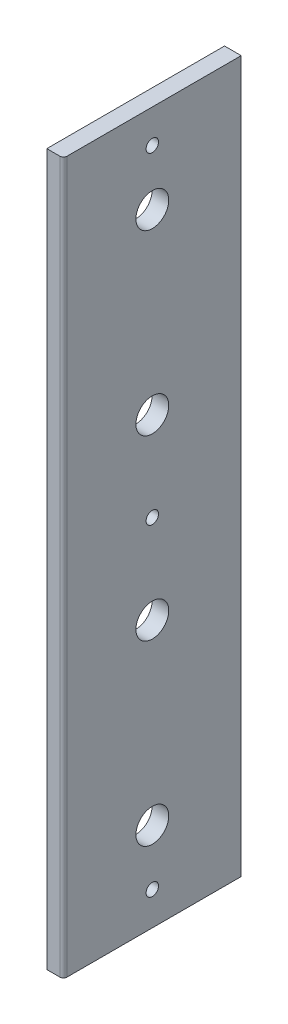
ISO-10303-21;
HEADER;
FILE_DESCRIPTION(('STEP AP214'),'2;1');
FILE_NAME('part.step','',(''),(''),'','','');
FILE_SCHEMA(('AUTOMOTIVE_DESIGN { 1 0 10303 214 1 1 1 1 }'));
ENDSEC;
DATA;
#1=APPLICATION_CONTEXT('core data for automotive mechanical design processes');
#2=APPLICATION_PROTOCOL_DEFINITION('international standard','automotive_design',2000,#1);
#3=PRODUCT_CONTEXT('',#1,'mechanical');
#4=PRODUCT('Part','Part','',(#3));
#5=PRODUCT_RELATED_PRODUCT_CATEGORY('part','',(#4));
#6=PRODUCT_DEFINITION_FORMATION('','',#4);
#7=PRODUCT_DEFINITION_CONTEXT('part definition',#1,'design');
#8=PRODUCT_DEFINITION('design','',#6,#7);
#9=PRODUCT_DEFINITION_SHAPE('','',#8);
#10=(LENGTH_UNIT() NAMED_UNIT(*) SI_UNIT(.MILLI.,.METRE.));
#11=(NAMED_UNIT(*) PLANE_ANGLE_UNIT() SI_UNIT($,.RADIAN.));
#12=(NAMED_UNIT(*) SI_UNIT($,.STERADIAN.) SOLID_ANGLE_UNIT());
#13=UNCERTAINTY_MEASURE_WITH_UNIT(LENGTH_MEASURE(1.E-05),#10,'distance_accuracy_value','');
#14=(GEOMETRIC_REPRESENTATION_CONTEXT(3) GLOBAL_UNCERTAINTY_ASSIGNED_CONTEXT((#13)) GLOBAL_UNIT_ASSIGNED_CONTEXT((#10,
#11,#12)) REPRESENTATION_CONTEXT('',''));
#15=CARTESIAN_POINT('',(0.,0.,0.));
#16=DIRECTION('',(0.,0.,1.));
#17=DIRECTION('',(1.,0.,0.));
#18=AXIS2_PLACEMENT_3D('',#15,#16,#17);
#19=CARTESIAN_POINT('',(4.7625,-25.4,0.));
#20=DIRECTION('',(0.,1.,0.));
#21=DIRECTION('',(0.,0.,1.));
#22=AXIS2_PLACEMENT_3D('',#19,#20,#21);
#23=PLANE('',#22);
#24=DIRECTION('',(0.,0.,-1.));
#25=VECTOR('',#24,1.);
#26=CARTESIAN_POINT('',(4.7625,-25.4,0.));
#27=LINE('',#26,#25);
#28=CARTESIAN_POINT('',(4.7625,-25.4,24.399999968));
#29=VERTEX_POINT('',#28);
#30=CARTESIAN_POINT('',(4.7625,-25.4,-25.4));
#31=VERTEX_POINT('',#30);
#32=EDGE_CURVE('E78',#29,#31,#27,.T.);
#33=ORIENTED_EDGE('',*,*,#32,.F.);
#34=CARTESIAN_POINT('',(3.762499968,-25.4,24.399999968));
#35=DIRECTION('',(0.,1.,0.));
#36=DIRECTION('',(0.,0.,1.));
#37=AXIS2_PLACEMENT_3D('',#34,#35,#36);
#38=CIRCLE('',#37,1.000000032);
#39=CARTESIAN_POINT('',(3.762499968,-25.4,25.4));
#40=VERTEX_POINT('',#39);
#41=EDGE_CURVE('E11',#29,#40,#38,.F.);
#42=ORIENTED_EDGE('',*,*,#41,.T.);
#43=DIRECTION('',(-1.,0.,0.));
#44=VECTOR('',#43,1.);
#45=CARTESIAN_POINT('',(4.7625,-25.4,25.4));
#46=LINE('',#45,#44);
#47=CARTESIAN_POINT('',(0.,-25.4,25.4));
#48=VERTEX_POINT('',#47);
#49=EDGE_CURVE('E108',#40,#48,#46,.T.);
#50=ORIENTED_EDGE('',*,*,#49,.T.);
#51=DIRECTION('',(0.,0.,-1.));
#52=VECTOR('',#51,1.);
#53=CARTESIAN_POINT('',(0.,-25.4,0.));
#54=LINE('',#53,#52);
#55=CARTESIAN_POINT('',(0.,-25.4,-25.4));
#56=VERTEX_POINT('',#55);
#57=EDGE_CURVE('E98',#48,#56,#54,.T.);
#58=ORIENTED_EDGE('',*,*,#57,.T.);
#59=DIRECTION('',(-1.,0.,0.));
#60=VECTOR('',#59,1.);
#61=CARTESIAN_POINT('',(4.7625,-25.4,-25.4));
#62=LINE('',#61,#60);
#63=EDGE_CURVE('E92',#31,#56,#62,.T.);
#64=ORIENTED_EDGE('',*,*,#63,.F.);
#65=EDGE_LOOP('',(#33,#42,#50,#58,#64));
#66=FACE_BOUND('',#65,.T.);
#67=ADVANCED_FACE('F35',(#66),#23,.F.);
#68=CARTESIAN_POINT('',(4.7625,0.,-25.4));
#69=DIRECTION('',(0.,0.,1.));
#70=DIRECTION('',(1.,0.,0.));
#71=AXIS2_PLACEMENT_3D('',#68,#69,#70);
#72=PLANE('',#71);
#73=DIRECTION('',(0.,1.,0.));
#74=VECTOR('',#73,1.);
#75=CARTESIAN_POINT('',(0.,0.,-25.4));
#76=LINE('',#75,#74);
#77=CARTESIAN_POINT('',(0.,177.8,-25.4));
#78=VERTEX_POINT('',#77);
#79=EDGE_CURVE('E115',#56,#78,#76,.T.);
#80=ORIENTED_EDGE('',*,*,#79,.T.);
#81=DIRECTION('',(-1.,0.,0.));
#82=VECTOR('',#81,1.);
#83=CARTESIAN_POINT('',(4.7625,177.8,-25.4));
#84=LINE('',#83,#82);
#85=CARTESIAN_POINT('',(4.7625,177.8,-25.4));
#86=VERTEX_POINT('',#85);
#87=EDGE_CURVE('E94',#86,#78,#84,.T.);
#88=ORIENTED_EDGE('',*,*,#87,.F.);
#89=DIRECTION('',(0.,1.,0.));
#90=VECTOR('',#89,1.);
#91=CARTESIAN_POINT('',(4.7625,0.,-25.4));
#92=LINE('',#91,#90);
#93=EDGE_CURVE('E81',#31,#86,#92,.T.);
#94=ORIENTED_EDGE('',*,*,#93,.F.);
#95=ORIENTED_EDGE('',*,*,#63,.T.);
#96=EDGE_LOOP('',(#80,#88,#94,#95));
#97=FACE_BOUND('',#96,.T.);
#98=ADVANCED_FACE('F91',(#97),#72,.F.);
#99=CARTESIAN_POINT('',(4.7625,177.8,0.));
#100=DIRECTION('',(0.,1.,0.));
#101=DIRECTION('',(0.,0.,1.));
#102=AXIS2_PLACEMENT_3D('',#99,#100,#101);
#103=PLANE('',#102);
#104=DIRECTION('',(-1.,0.,0.));
#105=VECTOR('',#104,1.);
#106=CARTESIAN_POINT('',(4.7625,177.8,25.4));
#107=LINE('',#106,#105);
#108=CARTESIAN_POINT('',(3.762499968,177.8,25.4));
#109=VERTEX_POINT('',#108);
#110=CARTESIAN_POINT('',(0.,177.8,25.4));
#111=VERTEX_POINT('',#110);
#112=EDGE_CURVE('E103',#109,#111,#107,.T.);
#113=ORIENTED_EDGE('',*,*,#112,.F.);
#114=CARTESIAN_POINT('',(3.762499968,177.8,24.399999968));
#115=DIRECTION('',(0.,1.,0.));
#116=DIRECTION('',(0.,0.,1.));
#117=AXIS2_PLACEMENT_3D('',#114,#115,#116);
#118=CIRCLE('',#117,1.000000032);
#119=CARTESIAN_POINT('',(4.7625,177.8,24.399999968));
#120=VERTEX_POINT('',#119);
#121=EDGE_CURVE('E57',#109,#120,#118,.T.);
#122=ORIENTED_EDGE('',*,*,#121,.T.);
#123=DIRECTION('',(0.,0.,-1.));
#124=VECTOR('',#123,1.);
#125=CARTESIAN_POINT('',(4.7625,177.8,0.));
#126=LINE('',#125,#124);
#127=EDGE_CURVE('E95',#120,#86,#126,.T.);
#128=ORIENTED_EDGE('',*,*,#127,.T.);
#129=ORIENTED_EDGE('',*,*,#87,.T.);
#130=DIRECTION('',(0.,0.,-1.));
#131=VECTOR('',#130,1.);
#132=CARTESIAN_POINT('',(0.,177.8,0.));
#133=LINE('',#132,#131);
#134=EDGE_CURVE('E112',#111,#78,#133,.T.);
#135=ORIENTED_EDGE('',*,*,#134,.F.);
#136=EDGE_LOOP('',(#113,#122,#128,#129,#135));
#137=FACE_BOUND('',#136,.T.);
#138=ADVANCED_FACE('F204',(#137),#103,.T.);
#139=CARTESIAN_POINT('',(4.7625,0.,25.4));
#140=DIRECTION('',(0.,0.,1.));
#141=DIRECTION('',(1.,0.,0.));
#142=AXIS2_PLACEMENT_3D('',#139,#140,#141);
#143=PLANE('',#142);
#144=ORIENTED_EDGE('',*,*,#49,.F.);
#145=DIRECTION('',(0.,1.,0.));
#146=VECTOR('',#145,1.);
#147=CARTESIAN_POINT('',(3.762499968,0.,25.4));
#148=LINE('',#147,#146);
#149=EDGE_CURVE('E99',#40,#109,#148,.T.);
#150=ORIENTED_EDGE('',*,*,#149,.T.);
#151=ORIENTED_EDGE('',*,*,#112,.T.);
#152=DIRECTION('',(0.,1.,0.));
#153=VECTOR('',#152,1.);
#154=CARTESIAN_POINT('',(0.,0.,25.4));
#155=LINE('',#154,#153);
#156=EDGE_CURVE('E86',#48,#111,#155,.T.);
#157=ORIENTED_EDGE('',*,*,#156,.F.);
#158=EDGE_LOOP('',(#144,#150,#151,#157));
#159=FACE_BOUND('',#158,.T.);
#160=ADVANCED_FACE('F175',(#159),#143,.T.);
#161=CARTESIAN_POINT('',(4.7625,0.,0.));
#162=DIRECTION('',(1.,0.,0.));
#163=DIRECTION('',(0.,0.,-1.));
#164=AXIS2_PLACEMENT_3D('',#161,#162,#163);
#165=PLANE('',#164);
#166=CARTESIAN_POINT('',(4.7625,-15.875,0.));
#167=DIRECTION('',(1.,0.,0.));
#168=DIRECTION('',(0.,0.,-1.));
#169=AXIS2_PLACEMENT_3D('',#166,#167,#168);
#170=CIRCLE('',#169,1.778);
#171=CARTESIAN_POINT('',(4.7625,-15.875,-1.77800000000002));
#172=VERTEX_POINT('',#171);
#173=EDGE_CURVE('E150',#172,#172,#170,.T.);
#174=ORIENTED_EDGE('',*,*,#173,.F.);
#175=EDGE_LOOP('',(#174));
#176=FACE_BOUND('',#175,.T.);
#177=CARTESIAN_POINT('',(4.7625,168.275,0.));
#178=DIRECTION('',(1.,0.,0.));
#179=DIRECTION('',(0.,0.,-1.));
#180=AXIS2_PLACEMENT_3D('',#177,#178,#179);
#181=CIRCLE('',#180,1.778);
#182=CARTESIAN_POINT('',(4.7625,168.275,-1.778));
#183=VERTEX_POINT('',#182);
#184=EDGE_CURVE('E156',#183,#183,#181,.T.);
#185=ORIENTED_EDGE('',*,*,#184,.F.);
#186=EDGE_LOOP('',(#185));
#187=FACE_BOUND('',#186,.T.);
#188=CARTESIAN_POINT('',(4.7625,76.2,0.));
#189=DIRECTION('',(1.,0.,0.));
#190=DIRECTION('',(0.,0.,-1.));
#191=AXIS2_PLACEMENT_3D('',#188,#189,#190);
#192=CIRCLE('',#191,1.778);
#193=CARTESIAN_POINT('',(4.7625,76.2,-1.778));
#194=VERTEX_POINT('',#193);
#195=EDGE_CURVE('E144',#194,#194,#192,.T.);
#196=ORIENTED_EDGE('',*,*,#195,.F.);
#197=EDGE_LOOP('',(#196));
#198=FACE_BOUND('',#197,.T.);
#199=CARTESIAN_POINT('',(4.7625,0.,0.));
#200=DIRECTION('',(1.,0.,0.));
#201=DIRECTION('',(0.,0.,-1.));
#202=AXIS2_PLACEMENT_3D('',#199,#200,#201);
#203=CIRCLE('',#202,4.699);
#204=CARTESIAN_POINT('',(4.7625,0.,4.699));
#205=VERTEX_POINT('',#204);
#206=EDGE_CURVE('E126',#205,#205,#203,.T.);
#207=ORIENTED_EDGE('',*,*,#206,.F.);
#208=EDGE_LOOP('',(#207));
#209=FACE_BOUND('',#208,.T.);
#210=CARTESIAN_POINT('',(4.7625,50.8,0.));
#211=DIRECTION('',(1.,0.,0.));
#212=DIRECTION('',(0.,0.,-1.));
#213=AXIS2_PLACEMENT_3D('',#210,#211,#212);
#214=CIRCLE('',#213,4.699);
#215=CARTESIAN_POINT('',(4.7625,50.8,4.699));
#216=VERTEX_POINT('',#215);
#217=EDGE_CURVE('E133',#216,#216,#214,.T.);
#218=ORIENTED_EDGE('',*,*,#217,.F.);
#219=EDGE_LOOP('',(#218));
#220=FACE_BOUND('',#219,.T.);
#221=CARTESIAN_POINT('',(4.7625,152.4,0.));
#222=DIRECTION('',(1.,0.,0.));
#223=DIRECTION('',(0.,0.,-1.));
#224=AXIS2_PLACEMENT_3D('',#221,#222,#223);
#225=CIRCLE('',#224,4.699);
#226=CARTESIAN_POINT('',(4.7625,152.4,4.699));
#227=VERTEX_POINT('',#226);
#228=EDGE_CURVE('E139',#227,#227,#225,.T.);
#229=ORIENTED_EDGE('',*,*,#228,.F.);
#230=EDGE_LOOP('',(#229));
#231=FACE_BOUND('',#230,.T.);
#232=CARTESIAN_POINT('',(4.7625,101.6,0.));
#233=DIRECTION('',(1.,0.,0.));
#234=DIRECTION('',(0.,0.,-1.));
#235=AXIS2_PLACEMENT_3D('',#232,#233,#234);
#236=CIRCLE('',#235,4.699);
#237=CARTESIAN_POINT('',(4.7625,101.6,4.699));
#238=VERTEX_POINT('',#237);
#239=EDGE_CURVE('E118',#238,#238,#236,.T.);
#240=ORIENTED_EDGE('',*,*,#239,.F.);
#241=EDGE_LOOP('',(#240));
#242=FACE_BOUND('',#241,.T.);
#243=ORIENTED_EDGE('',*,*,#127,.F.);
#244=DIRECTION('',(0.,1.,0.));
#245=VECTOR('',#244,1.);
#246=CARTESIAN_POINT('',(4.7625,0.,24.399999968));
#247=LINE('',#246,#245);
#248=EDGE_CURVE('E43',#120,#29,#247,.F.);
#249=ORIENTED_EDGE('',*,*,#248,.T.);
#250=ORIENTED_EDGE('',*,*,#32,.T.);
#251=ORIENTED_EDGE('',*,*,#93,.T.);
#252=EDGE_LOOP('',(#243,#249,#250,#251));
#253=FACE_BOUND('',#252,.T.);
#254=ADVANCED_FACE('F80',(#176,#187,#198,#209,#220,#231,#242,#253),#165,.T.);
#255=CARTESIAN_POINT('',(0.,0.,0.));
#256=DIRECTION('',(1.,0.,0.));
#257=DIRECTION('',(0.,0.,-1.));
#258=AXIS2_PLACEMENT_3D('',#255,#256,#257);
#259=PLANE('',#258);
#260=CARTESIAN_POINT('',(0.,-15.875,0.));
#261=DIRECTION('',(1.,0.,0.));
#262=DIRECTION('',(0.,0.,-1.));
#263=AXIS2_PLACEMENT_3D('',#260,#261,#262);
#264=CIRCLE('',#263,1.778);
#265=CARTESIAN_POINT('',(0.,-15.875,-1.77800000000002));
#266=VERTEX_POINT('',#265);
#267=EDGE_CURVE('E153',#266,#266,#264,.T.);
#268=ORIENTED_EDGE('',*,*,#267,.T.);
#269=EDGE_LOOP('',(#268));
#270=FACE_BOUND('',#269,.T.);
#271=CARTESIAN_POINT('',(0.,168.275,0.));
#272=DIRECTION('',(1.,0.,0.));
#273=DIRECTION('',(0.,0.,-1.));
#274=AXIS2_PLACEMENT_3D('',#271,#272,#273);
#275=CIRCLE('',#274,1.778);
#276=CARTESIAN_POINT('',(0.,168.275,-1.778));
#277=VERTEX_POINT('',#276);
#278=EDGE_CURVE('E147',#277,#277,#275,.T.);
#279=ORIENTED_EDGE('',*,*,#278,.T.);
#280=EDGE_LOOP('',(#279));
#281=FACE_BOUND('',#280,.T.);
#282=CARTESIAN_POINT('',(0.,76.2,0.));
#283=DIRECTION('',(1.,0.,0.));
#284=DIRECTION('',(0.,0.,-1.));
#285=AXIS2_PLACEMENT_3D('',#282,#283,#284);
#286=CIRCLE('',#285,1.778);
#287=CARTESIAN_POINT('',(0.,76.2,-1.778));
#288=VERTEX_POINT('',#287);
#289=EDGE_CURVE('E130',#288,#288,#286,.T.);
#290=ORIENTED_EDGE('',*,*,#289,.T.);
#291=EDGE_LOOP('',(#290));
#292=FACE_BOUND('',#291,.T.);
#293=CARTESIAN_POINT('',(0.,0.,0.));
#294=DIRECTION('',(1.,0.,0.));
#295=DIRECTION('',(0.,0.,-1.));
#296=AXIS2_PLACEMENT_3D('',#293,#294,#295);
#297=CIRCLE('',#296,4.699);
#298=CARTESIAN_POINT('',(0.,0.,4.699));
#299=VERTEX_POINT('',#298);
#300=EDGE_CURVE('E129',#299,#299,#297,.T.);
#301=ORIENTED_EDGE('',*,*,#300,.T.);
#302=EDGE_LOOP('',(#301));
#303=FACE_BOUND('',#302,.T.);
#304=CARTESIAN_POINT('',(0.,50.8,0.));
#305=DIRECTION('',(1.,0.,0.));
#306=DIRECTION('',(0.,0.,-1.));
#307=AXIS2_PLACEMENT_3D('',#304,#305,#306);
#308=CIRCLE('',#307,4.699);
#309=CARTESIAN_POINT('',(0.,50.8,4.699));
#310=VERTEX_POINT('',#309);
#311=EDGE_CURVE('E136',#310,#310,#308,.T.);
#312=ORIENTED_EDGE('',*,*,#311,.T.);
#313=EDGE_LOOP('',(#312));
#314=FACE_BOUND('',#313,.T.);
#315=CARTESIAN_POINT('',(0.,152.4,0.));
#316=DIRECTION('',(1.,0.,0.));
#317=DIRECTION('',(0.,0.,-1.));
#318=AXIS2_PLACEMENT_3D('',#315,#316,#317);
#319=CIRCLE('',#318,4.699);
#320=CARTESIAN_POINT('',(0.,152.4,4.699));
#321=VERTEX_POINT('',#320);
#322=EDGE_CURVE('E123',#321,#321,#319,.T.);
#323=ORIENTED_EDGE('',*,*,#322,.T.);
#324=EDGE_LOOP('',(#323));
#325=FACE_BOUND('',#324,.T.);
#326=CARTESIAN_POINT('',(0.,101.6,0.));
#327=DIRECTION('',(1.,0.,0.));
#328=DIRECTION('',(0.,0.,-1.));
#329=AXIS2_PLACEMENT_3D('',#326,#327,#328);
#330=CIRCLE('',#329,4.699);
#331=CARTESIAN_POINT('',(0.,101.6,4.699));
#332=VERTEX_POINT('',#331);
#333=EDGE_CURVE('E120',#332,#332,#330,.T.);
#334=ORIENTED_EDGE('',*,*,#333,.T.);
#335=EDGE_LOOP('',(#334));
#336=FACE_BOUND('',#335,.T.);
#337=ORIENTED_EDGE('',*,*,#57,.F.);
#338=ORIENTED_EDGE('',*,*,#156,.T.);
#339=ORIENTED_EDGE('',*,*,#134,.T.);
#340=ORIENTED_EDGE('',*,*,#79,.F.);
#341=EDGE_LOOP('',(#337,#338,#339,#340));
#342=FACE_BOUND('',#341,.T.);
#343=ADVANCED_FACE('F162',(#270,#281,#292,#303,#314,#325,#336,#342),#259,.F.);
#344=CARTESIAN_POINT('',(4.7625,101.6,0.));
#345=DIRECTION('',(-1.,0.,0.));
#346=DIRECTION('',(0.,0.,1.));
#347=AXIS2_PLACEMENT_3D('',#344,#345,#346);
#348=CYLINDRICAL_SURFACE('',#347,4.699);
#349=CARTESIAN_POINT('',(4.7625,101.6,4.699));
#350=CARTESIAN_POINT('',(4.712890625,101.6,4.699));
#351=CARTESIAN_POINT('',(4.66328125,101.6,4.699));
#352=CARTESIAN_POINT('',(4.5640625,101.6,4.699));
#353=CARTESIAN_POINT('',(4.514453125,101.6,4.699));
#354=CARTESIAN_POINT('',(4.415234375,101.6,4.699));
#355=CARTESIAN_POINT('',(4.365625,101.6,4.699));
#356=CARTESIAN_POINT('',(4.26640625,101.6,4.699));
#357=CARTESIAN_POINT('',(4.216796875,101.6,4.699));
#358=CARTESIAN_POINT('',(4.117578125,101.6,4.699));
#359=CARTESIAN_POINT('',(4.06796875,101.6,4.699));
#360=CARTESIAN_POINT('',(3.96875,101.6,4.699));
#361=CARTESIAN_POINT('',(3.919140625,101.6,4.699));
#362=CARTESIAN_POINT('',(3.819921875,101.6,4.699));
#363=CARTESIAN_POINT('',(3.7703125,101.6,4.699));
#364=CARTESIAN_POINT('',(3.67109375,101.6,4.699));
#365=CARTESIAN_POINT('',(3.621484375,101.6,4.699));
#366=CARTESIAN_POINT('',(3.522265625,101.6,4.699));
#367=CARTESIAN_POINT('',(3.47265625,101.6,4.699));
#368=CARTESIAN_POINT('',(3.3734375,101.6,4.699));
#369=CARTESIAN_POINT('',(3.323828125,101.6,4.699));
#370=CARTESIAN_POINT('',(3.224609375,101.6,4.699));
#371=CARTESIAN_POINT('',(3.175,101.6,4.699));
#372=CARTESIAN_POINT('',(3.07578125,101.6,4.699));
#373=CARTESIAN_POINT('',(3.026171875,101.6,4.699));
#374=CARTESIAN_POINT('',(2.926953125,101.6,4.699));
#375=CARTESIAN_POINT('',(2.87734375,101.6,4.699));
#376=CARTESIAN_POINT('',(2.778125,101.6,4.699));
#377=CARTESIAN_POINT('',(2.728515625,101.6,4.699));
#378=CARTESIAN_POINT('',(2.629296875,101.6,4.699));
#379=CARTESIAN_POINT('',(2.5796875,101.6,4.699));
#380=CARTESIAN_POINT('',(2.48046875,101.6,4.699));
#381=CARTESIAN_POINT('',(2.430859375,101.6,4.699));
#382=CARTESIAN_POINT('',(2.331640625,101.6,4.699));
#383=CARTESIAN_POINT('',(2.28203125,101.6,4.699));
#384=CARTESIAN_POINT('',(2.1828125,101.6,4.699));
#385=CARTESIAN_POINT('',(2.133203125,101.6,4.699));
#386=CARTESIAN_POINT('',(2.033984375,101.6,4.699));
#387=CARTESIAN_POINT('',(1.984375,101.6,4.699));
#388=CARTESIAN_POINT('',(1.88515625,101.6,4.699));
#389=CARTESIAN_POINT('',(1.835546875,101.6,4.699));
#390=CARTESIAN_POINT('',(1.736328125,101.6,4.699));
#391=CARTESIAN_POINT('',(1.68671875,101.6,4.699));
#392=CARTESIAN_POINT('',(1.5875,101.6,4.699));
#393=CARTESIAN_POINT('',(1.537890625,101.6,4.699));
#394=CARTESIAN_POINT('',(1.438671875,101.6,4.699));
#395=CARTESIAN_POINT('',(1.3890625,101.6,4.699));
#396=CARTESIAN_POINT('',(1.28984375,101.6,4.699));
#397=CARTESIAN_POINT('',(1.240234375,101.6,4.699));
#398=CARTESIAN_POINT('',(1.141015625,101.6,4.699));
#399=CARTESIAN_POINT('',(1.09140625,101.6,4.699));
#400=CARTESIAN_POINT('',(0.992187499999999,101.6,4.699));
#401=CARTESIAN_POINT('',(0.942578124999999,101.6,4.699));
#402=CARTESIAN_POINT('',(0.843359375,101.6,4.699));
#403=CARTESIAN_POINT('',(0.79375,101.6,4.699));
#404=CARTESIAN_POINT('',(0.69453125,101.6,4.699));
#405=CARTESIAN_POINT('',(0.644921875,101.6,4.699));
#406=CARTESIAN_POINT('',(0.545703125,101.6,4.699));
#407=CARTESIAN_POINT('',(0.49609375,101.6,4.699));
#408=CARTESIAN_POINT('',(0.396875,101.6,4.699));
#409=CARTESIAN_POINT('',(0.347265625,101.6,4.699));
#410=CARTESIAN_POINT('',(0.248046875,101.6,4.699));
#411=CARTESIAN_POINT('',(0.1984375,101.6,4.699));
#412=CARTESIAN_POINT('',(0.09921875,101.6,4.699));
#413=CARTESIAN_POINT('',(0.049609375,101.6,4.699));
#414=CARTESIAN_POINT('',(0.,101.6,4.699));
#415=B_SPLINE_CURVE_WITH_KNOTS('',3,(#349,#350,#351,#352,#353,#354,#355,#356,#357,#358,#359,
#360,#361,#362,#363,#364,#365,#366,#367,#368,#369,#370,#371,#372,#373,#374,#375,#376,#377,#378,
#379,#380,#381,#382,#383,#384,#385,#386,#387,#388,#389,#390,#391,#392,#393,#394,#395,#396,#397,
#398,#399,#400,#401,#402,#403,#404,#405,#406,#407,#408,#409,#410,#411,#412,#413,#414),
.UNSPECIFIED.,.F.,.F.,(4,2,2,2,2,2,2,2,2,2,2,2,2,2,2,2,2,2,2,2,2,2,2,2,2,2,2,2,2,2,2,2,4),(0.,
0.148828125,0.29765625,0.446484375,0.5953125,0.744140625,0.892968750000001,1.041796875,1.190625,
1.339453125,1.48828125,1.637109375,1.7859375,1.934765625,2.08359375,2.232421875,2.38125,
2.530078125,2.67890625,2.827734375,2.9765625,3.125390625,3.27421875,3.423046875,3.571875,
3.720703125,3.86953125,4.018359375,4.1671875,4.316015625,4.46484375,4.613671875,4.7625),.UNSPECIFIED.);
#416=EDGE_CURVE('BSEAM188',#238,#332,#415,.T.);
#417=ORIENTED_EDGE('',*,*,#239,.T.);
#418=ORIENTED_EDGE('',*,*,#333,.F.);
#419=ORIENTED_EDGE('',*,*,#416,.T.);
#420=ORIENTED_EDGE('',*,*,#416,.F.);
#421=EDGE_LOOP('',(#417,#419,#418,#420));
#422=FACE_BOUND('',#421,.T.);
#423=ADVANCED_FACE('F188',(#422),#348,.F.);
#424=CARTESIAN_POINT('',(4.7625,152.4,0.));
#425=DIRECTION('',(-1.,0.,0.));
#426=DIRECTION('',(0.,0.,1.));
#427=AXIS2_PLACEMENT_3D('',#424,#425,#426);
#428=CYLINDRICAL_SURFACE('',#427,4.699);
#429=CARTESIAN_POINT('',(4.7625,152.4,4.699));
#430=CARTESIAN_POINT('',(4.712890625,152.4,4.699));
#431=CARTESIAN_POINT('',(4.66328125,152.4,4.699));
#432=CARTESIAN_POINT('',(4.5640625,152.4,4.699));
#433=CARTESIAN_POINT('',(4.514453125,152.4,4.699));
#434=CARTESIAN_POINT('',(4.415234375,152.4,4.699));
#435=CARTESIAN_POINT('',(4.365625,152.4,4.699));
#436=CARTESIAN_POINT('',(4.26640625,152.4,4.699));
#437=CARTESIAN_POINT('',(4.216796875,152.4,4.699));
#438=CARTESIAN_POINT('',(4.117578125,152.4,4.699));
#439=CARTESIAN_POINT('',(4.06796875,152.4,4.699));
#440=CARTESIAN_POINT('',(3.96875,152.4,4.699));
#441=CARTESIAN_POINT('',(3.919140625,152.4,4.699));
#442=CARTESIAN_POINT('',(3.819921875,152.4,4.699));
#443=CARTESIAN_POINT('',(3.7703125,152.4,4.699));
#444=CARTESIAN_POINT('',(3.67109375,152.4,4.699));
#445=CARTESIAN_POINT('',(3.621484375,152.4,4.699));
#446=CARTESIAN_POINT('',(3.522265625,152.4,4.699));
#447=CARTESIAN_POINT('',(3.47265625,152.4,4.699));
#448=CARTESIAN_POINT('',(3.3734375,152.4,4.699));
#449=CARTESIAN_POINT('',(3.323828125,152.4,4.699));
#450=CARTESIAN_POINT('',(3.224609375,152.4,4.699));
#451=CARTESIAN_POINT('',(3.175,152.4,4.699));
#452=CARTESIAN_POINT('',(3.07578125,152.4,4.699));
#453=CARTESIAN_POINT('',(3.026171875,152.4,4.699));
#454=CARTESIAN_POINT('',(2.926953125,152.4,4.699));
#455=CARTESIAN_POINT('',(2.87734375,152.4,4.699));
#456=CARTESIAN_POINT('',(2.778125,152.4,4.699));
#457=CARTESIAN_POINT('',(2.728515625,152.4,4.699));
#458=CARTESIAN_POINT('',(2.629296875,152.4,4.699));
#459=CARTESIAN_POINT('',(2.5796875,152.4,4.699));
#460=CARTESIAN_POINT('',(2.48046875,152.4,4.699));
#461=CARTESIAN_POINT('',(2.430859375,152.4,4.699));
#462=CARTESIAN_POINT('',(2.331640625,152.4,4.699));
#463=CARTESIAN_POINT('',(2.28203125,152.4,4.699));
#464=CARTESIAN_POINT('',(2.1828125,152.4,4.699));
#465=CARTESIAN_POINT('',(2.133203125,152.4,4.699));
#466=CARTESIAN_POINT('',(2.033984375,152.4,4.699));
#467=CARTESIAN_POINT('',(1.984375,152.4,4.699));
#468=CARTESIAN_POINT('',(1.88515625,152.4,4.699));
#469=CARTESIAN_POINT('',(1.835546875,152.4,4.699));
#470=CARTESIAN_POINT('',(1.736328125,152.4,4.699));
#471=CARTESIAN_POINT('',(1.68671875,152.4,4.699));
#472=CARTESIAN_POINT('',(1.5875,152.4,4.699));
#473=CARTESIAN_POINT('',(1.537890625,152.4,4.699));
#474=CARTESIAN_POINT('',(1.438671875,152.4,4.699));
#475=CARTESIAN_POINT('',(1.3890625,152.4,4.699));
#476=CARTESIAN_POINT('',(1.28984375,152.4,4.699));
#477=CARTESIAN_POINT('',(1.240234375,152.4,4.699));
#478=CARTESIAN_POINT('',(1.141015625,152.4,4.699));
#479=CARTESIAN_POINT('',(1.09140625,152.4,4.699));
#480=CARTESIAN_POINT('',(0.992187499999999,152.4,4.699));
#481=CARTESIAN_POINT('',(0.942578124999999,152.4,4.699));
#482=CARTESIAN_POINT('',(0.843359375,152.4,4.699));
#483=CARTESIAN_POINT('',(0.79375,152.4,4.699));
#484=CARTESIAN_POINT('',(0.69453125,152.4,4.699));
#485=CARTESIAN_POINT('',(0.644921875,152.4,4.699));
#486=CARTESIAN_POINT('',(0.545703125,152.4,4.699));
#487=CARTESIAN_POINT('',(0.49609375,152.4,4.699));
#488=CARTESIAN_POINT('',(0.396875,152.4,4.699));
#489=CARTESIAN_POINT('',(0.347265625,152.4,4.699));
#490=CARTESIAN_POINT('',(0.248046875,152.4,4.699));
#491=CARTESIAN_POINT('',(0.1984375,152.4,4.699));
#492=CARTESIAN_POINT('',(0.09921875,152.4,4.699));
#493=CARTESIAN_POINT('',(0.049609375,152.4,4.699));
#494=CARTESIAN_POINT('',(0.,152.4,4.699));
#495=B_SPLINE_CURVE_WITH_KNOTS('',3,(#429,#430,#431,#432,#433,#434,#435,#436,#437,#438,#439,
#440,#441,#442,#443,#444,#445,#446,#447,#448,#449,#450,#451,#452,#453,#454,#455,#456,#457,#458,
#459,#460,#461,#462,#463,#464,#465,#466,#467,#468,#469,#470,#471,#472,#473,#474,#475,#476,#477,
#478,#479,#480,#481,#482,#483,#484,#485,#486,#487,#488,#489,#490,#491,#492,#493,#494),
.UNSPECIFIED.,.F.,.F.,(4,2,2,2,2,2,2,2,2,2,2,2,2,2,2,2,2,2,2,2,2,2,2,2,2,2,2,2,2,2,2,2,4),(0.,
0.148828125,0.29765625,0.446484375,0.5953125,0.744140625,0.892968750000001,1.041796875,1.190625,
1.339453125,1.48828125,1.637109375,1.7859375,1.934765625,2.08359375,2.232421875,2.38125,
2.530078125,2.67890625,2.827734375,2.9765625,3.125390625,3.27421875,3.423046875,3.571875,
3.720703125,3.86953125,4.018359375,4.1671875,4.316015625,4.46484375,4.613671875,4.7625),.UNSPECIFIED.);
#496=EDGE_CURVE('BSEAM191',#227,#321,#495,.T.);
#497=ORIENTED_EDGE('',*,*,#228,.T.);
#498=ORIENTED_EDGE('',*,*,#322,.F.);
#499=ORIENTED_EDGE('',*,*,#496,.T.);
#500=ORIENTED_EDGE('',*,*,#496,.F.);
#501=EDGE_LOOP('',(#497,#499,#498,#500));
#502=FACE_BOUND('',#501,.T.);
#503=ADVANCED_FACE('F191',(#502),#428,.F.);
#504=CARTESIAN_POINT('',(4.7625,50.8,0.));
#505=DIRECTION('',(-1.,0.,0.));
#506=DIRECTION('',(0.,0.,1.));
#507=AXIS2_PLACEMENT_3D('',#504,#505,#506);
#508=CYLINDRICAL_SURFACE('',#507,4.699);
#509=CARTESIAN_POINT('',(4.7625,50.8,4.699));
#510=CARTESIAN_POINT('',(4.712890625,50.8,4.699));
#511=CARTESIAN_POINT('',(4.66328125,50.8,4.699));
#512=CARTESIAN_POINT('',(4.5640625,50.8,4.699));
#513=CARTESIAN_POINT('',(4.514453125,50.8,4.699));
#514=CARTESIAN_POINT('',(4.415234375,50.8,4.699));
#515=CARTESIAN_POINT('',(4.365625,50.8,4.699));
#516=CARTESIAN_POINT('',(4.26640625,50.8,4.699));
#517=CARTESIAN_POINT('',(4.216796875,50.8,4.699));
#518=CARTESIAN_POINT('',(4.117578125,50.8,4.699));
#519=CARTESIAN_POINT('',(4.06796875,50.8,4.699));
#520=CARTESIAN_POINT('',(3.96875,50.8,4.699));
#521=CARTESIAN_POINT('',(3.919140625,50.8,4.699));
#522=CARTESIAN_POINT('',(3.819921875,50.8,4.699));
#523=CARTESIAN_POINT('',(3.7703125,50.8,4.699));
#524=CARTESIAN_POINT('',(3.67109375,50.8,4.699));
#525=CARTESIAN_POINT('',(3.621484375,50.8,4.699));
#526=CARTESIAN_POINT('',(3.522265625,50.8,4.699));
#527=CARTESIAN_POINT('',(3.47265625,50.8,4.699));
#528=CARTESIAN_POINT('',(3.3734375,50.8,4.699));
#529=CARTESIAN_POINT('',(3.323828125,50.8,4.699));
#530=CARTESIAN_POINT('',(3.224609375,50.8,4.699));
#531=CARTESIAN_POINT('',(3.175,50.8,4.699));
#532=CARTESIAN_POINT('',(3.07578125,50.8,4.699));
#533=CARTESIAN_POINT('',(3.026171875,50.8,4.699));
#534=CARTESIAN_POINT('',(2.926953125,50.8,4.699));
#535=CARTESIAN_POINT('',(2.87734375,50.8,4.699));
#536=CARTESIAN_POINT('',(2.778125,50.8,4.699));
#537=CARTESIAN_POINT('',(2.728515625,50.8,4.699));
#538=CARTESIAN_POINT('',(2.629296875,50.8,4.699));
#539=CARTESIAN_POINT('',(2.5796875,50.8,4.699));
#540=CARTESIAN_POINT('',(2.48046875,50.8,4.699));
#541=CARTESIAN_POINT('',(2.430859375,50.8,4.699));
#542=CARTESIAN_POINT('',(2.331640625,50.8,4.699));
#543=CARTESIAN_POINT('',(2.28203125,50.8,4.699));
#544=CARTESIAN_POINT('',(2.1828125,50.8,4.699));
#545=CARTESIAN_POINT('',(2.133203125,50.8,4.699));
#546=CARTESIAN_POINT('',(2.033984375,50.8,4.699));
#547=CARTESIAN_POINT('',(1.984375,50.8,4.699));
#548=CARTESIAN_POINT('',(1.88515625,50.8,4.699));
#549=CARTESIAN_POINT('',(1.835546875,50.8,4.699));
#550=CARTESIAN_POINT('',(1.736328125,50.8,4.699));
#551=CARTESIAN_POINT('',(1.68671875,50.8,4.699));
#552=CARTESIAN_POINT('',(1.5875,50.8,4.699));
#553=CARTESIAN_POINT('',(1.537890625,50.8,4.699));
#554=CARTESIAN_POINT('',(1.438671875,50.8,4.699));
#555=CARTESIAN_POINT('',(1.3890625,50.8,4.699));
#556=CARTESIAN_POINT('',(1.28984375,50.8,4.699));
#557=CARTESIAN_POINT('',(1.240234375,50.8,4.699));
#558=CARTESIAN_POINT('',(1.141015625,50.8,4.699));
#559=CARTESIAN_POINT('',(1.09140625,50.8,4.699));
#560=CARTESIAN_POINT('',(0.992187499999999,50.8,4.699));
#561=CARTESIAN_POINT('',(0.942578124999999,50.8,4.699));
#562=CARTESIAN_POINT('',(0.843359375,50.8,4.699));
#563=CARTESIAN_POINT('',(0.79375,50.8,4.699));
#564=CARTESIAN_POINT('',(0.69453125,50.8,4.699));
#565=CARTESIAN_POINT('',(0.644921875,50.8,4.699));
#566=CARTESIAN_POINT('',(0.545703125,50.8,4.699));
#567=CARTESIAN_POINT('',(0.49609375,50.8,4.699));
#568=CARTESIAN_POINT('',(0.396875,50.8,4.699));
#569=CARTESIAN_POINT('',(0.347265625,50.8,4.699));
#570=CARTESIAN_POINT('',(0.248046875,50.8,4.699));
#571=CARTESIAN_POINT('',(0.1984375,50.8,4.699));
#572=CARTESIAN_POINT('',(0.09921875,50.8,4.699));
#573=CARTESIAN_POINT('',(0.049609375,50.8,4.699));
#574=CARTESIAN_POINT('',(0.,50.8,4.699));
#575=B_SPLINE_CURVE_WITH_KNOTS('',3,(#509,#510,#511,#512,#513,#514,#515,#516,#517,#518,#519,
#520,#521,#522,#523,#524,#525,#526,#527,#528,#529,#530,#531,#532,#533,#534,#535,#536,#537,#538,
#539,#540,#541,#542,#543,#544,#545,#546,#547,#548,#549,#550,#551,#552,#553,#554,#555,#556,#557,
#558,#559,#560,#561,#562,#563,#564,#565,#566,#567,#568,#569,#570,#571,#572,#573,#574),
.UNSPECIFIED.,.F.,.F.,(4,2,2,2,2,2,2,2,2,2,2,2,2,2,2,2,2,2,2,2,2,2,2,2,2,2,2,2,2,2,2,2,4),(0.,
0.148828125,0.29765625,0.446484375,0.5953125,0.744140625,0.892968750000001,1.041796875,1.190625,
1.339453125,1.48828125,1.637109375,1.7859375,1.934765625,2.08359375,2.232421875,2.38125,
2.530078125,2.67890625,2.827734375,2.9765625,3.125390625,3.27421875,3.423046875,3.571875,
3.720703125,3.86953125,4.018359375,4.1671875,4.316015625,4.46484375,4.613671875,4.7625),.UNSPECIFIED.);
#576=EDGE_CURVE('BSEAM225',#216,#310,#575,.T.);
#577=ORIENTED_EDGE('',*,*,#217,.T.);
#578=ORIENTED_EDGE('',*,*,#311,.F.);
#579=ORIENTED_EDGE('',*,*,#576,.T.);
#580=ORIENTED_EDGE('',*,*,#576,.F.);
#581=EDGE_LOOP('',(#577,#579,#578,#580));
#582=FACE_BOUND('',#581,.T.);
#583=ADVANCED_FACE('F225',(#582),#508,.F.);
#584=CARTESIAN_POINT('',(4.7625,0.,0.));
#585=DIRECTION('',(-1.,0.,0.));
#586=DIRECTION('',(0.,0.,1.));
#587=AXIS2_PLACEMENT_3D('',#584,#585,#586);
#588=CYLINDRICAL_SURFACE('',#587,4.699);
#589=CARTESIAN_POINT('',(4.7625,0.,4.699));
#590=CARTESIAN_POINT('',(4.712890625,0.,4.699));
#591=CARTESIAN_POINT('',(4.66328125,0.,4.699));
#592=CARTESIAN_POINT('',(4.5640625,0.,4.699));
#593=CARTESIAN_POINT('',(4.514453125,0.,4.699));
#594=CARTESIAN_POINT('',(4.415234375,0.,4.699));
#595=CARTESIAN_POINT('',(4.365625,0.,4.699));
#596=CARTESIAN_POINT('',(4.26640625,0.,4.699));
#597=CARTESIAN_POINT('',(4.216796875,0.,4.699));
#598=CARTESIAN_POINT('',(4.117578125,0.,4.699));
#599=CARTESIAN_POINT('',(4.06796875,0.,4.699));
#600=CARTESIAN_POINT('',(3.96875,0.,4.699));
#601=CARTESIAN_POINT('',(3.919140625,0.,4.699));
#602=CARTESIAN_POINT('',(3.819921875,0.,4.699));
#603=CARTESIAN_POINT('',(3.7703125,0.,4.699));
#604=CARTESIAN_POINT('',(3.67109375,0.,4.699));
#605=CARTESIAN_POINT('',(3.621484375,0.,4.699));
#606=CARTESIAN_POINT('',(3.522265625,0.,4.699));
#607=CARTESIAN_POINT('',(3.47265625,0.,4.699));
#608=CARTESIAN_POINT('',(3.3734375,0.,4.699));
#609=CARTESIAN_POINT('',(3.323828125,0.,4.699));
#610=CARTESIAN_POINT('',(3.224609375,0.,4.699));
#611=CARTESIAN_POINT('',(3.175,0.,4.699));
#612=CARTESIAN_POINT('',(3.07578125,0.,4.699));
#613=CARTESIAN_POINT('',(3.026171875,0.,4.699));
#614=CARTESIAN_POINT('',(2.926953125,0.,4.699));
#615=CARTESIAN_POINT('',(2.87734375,0.,4.699));
#616=CARTESIAN_POINT('',(2.778125,0.,4.699));
#617=CARTESIAN_POINT('',(2.728515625,0.,4.699));
#618=CARTESIAN_POINT('',(2.629296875,0.,4.699));
#619=CARTESIAN_POINT('',(2.5796875,0.,4.699));
#620=CARTESIAN_POINT('',(2.48046875,0.,4.699));
#621=CARTESIAN_POINT('',(2.430859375,0.,4.699));
#622=CARTESIAN_POINT('',(2.331640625,0.,4.699));
#623=CARTESIAN_POINT('',(2.28203125,0.,4.699));
#624=CARTESIAN_POINT('',(2.1828125,0.,4.699));
#625=CARTESIAN_POINT('',(2.133203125,0.,4.699));
#626=CARTESIAN_POINT('',(2.033984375,0.,4.699));
#627=CARTESIAN_POINT('',(1.984375,0.,4.699));
#628=CARTESIAN_POINT('',(1.88515625,0.,4.699));
#629=CARTESIAN_POINT('',(1.835546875,0.,4.699));
#630=CARTESIAN_POINT('',(1.736328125,0.,4.699));
#631=CARTESIAN_POINT('',(1.68671875,0.,4.699));
#632=CARTESIAN_POINT('',(1.5875,0.,4.699));
#633=CARTESIAN_POINT('',(1.537890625,0.,4.699));
#634=CARTESIAN_POINT('',(1.438671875,0.,4.699));
#635=CARTESIAN_POINT('',(1.3890625,0.,4.699));
#636=CARTESIAN_POINT('',(1.28984375,0.,4.699));
#637=CARTESIAN_POINT('',(1.240234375,0.,4.699));
#638=CARTESIAN_POINT('',(1.141015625,0.,4.699));
#639=CARTESIAN_POINT('',(1.09140625,0.,4.699));
#640=CARTESIAN_POINT('',(0.992187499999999,0.,4.699));
#641=CARTESIAN_POINT('',(0.942578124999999,0.,4.699));
#642=CARTESIAN_POINT('',(0.843359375,0.,4.699));
#643=CARTESIAN_POINT('',(0.79375,0.,4.699));
#644=CARTESIAN_POINT('',(0.69453125,0.,4.699));
#645=CARTESIAN_POINT('',(0.644921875,0.,4.699));
#646=CARTESIAN_POINT('',(0.545703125,0.,4.699));
#647=CARTESIAN_POINT('',(0.49609375,0.,4.699));
#648=CARTESIAN_POINT('',(0.396875,0.,4.699));
#649=CARTESIAN_POINT('',(0.347265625,0.,4.699));
#650=CARTESIAN_POINT('',(0.248046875,0.,4.699));
#651=CARTESIAN_POINT('',(0.1984375,0.,4.699));
#652=CARTESIAN_POINT('',(0.09921875,0.,4.699));
#653=CARTESIAN_POINT('',(0.049609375,0.,4.699));
#654=CARTESIAN_POINT('',(0.,0.,4.699));
#655=B_SPLINE_CURVE_WITH_KNOTS('',3,(#589,#590,#591,#592,#593,#594,#595,#596,#597,#598,#599,
#600,#601,#602,#603,#604,#605,#606,#607,#608,#609,#610,#611,#612,#613,#614,#615,#616,#617,#618,
#619,#620,#621,#622,#623,#624,#625,#626,#627,#628,#629,#630,#631,#632,#633,#634,#635,#636,#637,
#638,#639,#640,#641,#642,#643,#644,#645,#646,#647,#648,#649,#650,#651,#652,#653,#654),
.UNSPECIFIED.,.F.,.F.,(4,2,2,2,2,2,2,2,2,2,2,2,2,2,2,2,2,2,2,2,2,2,2,2,2,2,2,2,2,2,2,2,4),(0.,
0.148828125,0.29765625,0.446484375,0.5953125,0.744140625,0.892968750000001,1.041796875,1.190625,
1.339453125,1.48828125,1.637109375,1.7859375,1.934765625,2.08359375,2.232421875,2.38125,
2.530078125,2.67890625,2.827734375,2.9765625,3.125390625,3.27421875,3.423046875,3.571875,
3.720703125,3.86953125,4.018359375,4.1671875,4.316015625,4.46484375,4.613671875,4.7625),.UNSPECIFIED.);
#656=EDGE_CURVE('BSEAM222',#205,#299,#655,.T.);
#657=ORIENTED_EDGE('',*,*,#206,.T.);
#658=ORIENTED_EDGE('',*,*,#300,.F.);
#659=ORIENTED_EDGE('',*,*,#656,.T.);
#660=ORIENTED_EDGE('',*,*,#656,.F.);
#661=EDGE_LOOP('',(#657,#659,#658,#660));
#662=FACE_BOUND('',#661,.T.);
#663=ADVANCED_FACE('F222',(#662),#588,.F.);
#664=CARTESIAN_POINT('',(0.,76.2,0.));
#665=DIRECTION('',(1.,0.,0.));
#666=DIRECTION('',(0.,0.,-1.));
#667=AXIS2_PLACEMENT_3D('',#664,#665,#666);
#668=CYLINDRICAL_SURFACE('',#667,1.778);
#669=CARTESIAN_POINT('',(0.,76.2,-1.778));
#670=CARTESIAN_POINT('',(0.049609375,76.2,-1.778));
#671=CARTESIAN_POINT('',(0.09921875,76.2,-1.778));
#672=CARTESIAN_POINT('',(0.1984375,76.2,-1.778));
#673=CARTESIAN_POINT('',(0.248046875,76.2,-1.778));
#674=CARTESIAN_POINT('',(0.347265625,76.2,-1.778));
#675=CARTESIAN_POINT('',(0.396875,76.2,-1.778));
#676=CARTESIAN_POINT('',(0.49609375,76.2,-1.778));
#677=CARTESIAN_POINT('',(0.545703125,76.2,-1.778));
#678=CARTESIAN_POINT('',(0.644921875,76.2,-1.778));
#679=CARTESIAN_POINT('',(0.69453125,76.2,-1.778));
#680=CARTESIAN_POINT('',(0.79375,76.2,-1.778));
#681=CARTESIAN_POINT('',(0.843359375,76.2,-1.778));
#682=CARTESIAN_POINT('',(0.942578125,76.2,-1.778));
#683=CARTESIAN_POINT('',(0.9921875,76.2,-1.778));
#684=CARTESIAN_POINT('',(1.09140625,76.2,-1.778));
#685=CARTESIAN_POINT('',(1.141015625,76.2,-1.778));
#686=CARTESIAN_POINT('',(1.240234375,76.2,-1.778));
#687=CARTESIAN_POINT('',(1.28984375,76.2,-1.778));
#688=CARTESIAN_POINT('',(1.3890625,76.2,-1.778));
#689=CARTESIAN_POINT('',(1.438671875,76.2,-1.778));
#690=CARTESIAN_POINT('',(1.537890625,76.2,-1.778));
#691=CARTESIAN_POINT('',(1.5875,76.2,-1.778));
#692=CARTESIAN_POINT('',(1.68671875,76.2,-1.778));
#693=CARTESIAN_POINT('',(1.736328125,76.2,-1.778));
#694=CARTESIAN_POINT('',(1.835546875,76.2,-1.778));
#695=CARTESIAN_POINT('',(1.88515625,76.2,-1.778));
#696=CARTESIAN_POINT('',(1.984375,76.2,-1.778));
#697=CARTESIAN_POINT('',(2.033984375,76.2,-1.778));
#698=CARTESIAN_POINT('',(2.133203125,76.2,-1.778));
#699=CARTESIAN_POINT('',(2.1828125,76.2,-1.778));
#700=CARTESIAN_POINT('',(2.28203125,76.2,-1.778));
#701=CARTESIAN_POINT('',(2.331640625,76.2,-1.778));
#702=CARTESIAN_POINT('',(2.430859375,76.2,-1.778));
#703=CARTESIAN_POINT('',(2.48046875,76.2,-1.778));
#704=CARTESIAN_POINT('',(2.5796875,76.2,-1.778));
#705=CARTESIAN_POINT('',(2.629296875,76.2,-1.778));
#706=CARTESIAN_POINT('',(2.728515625,76.2,-1.778));
#707=CARTESIAN_POINT('',(2.778125,76.2,-1.778));
#708=CARTESIAN_POINT('',(2.87734375,76.2,-1.778));
#709=CARTESIAN_POINT('',(2.926953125,76.2,-1.778));
#710=CARTESIAN_POINT('',(3.026171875,76.2,-1.778));
#711=CARTESIAN_POINT('',(3.07578125,76.2,-1.778));
#712=CARTESIAN_POINT('',(3.175,76.2,-1.778));
#713=CARTESIAN_POINT('',(3.224609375,76.2,-1.778));
#714=CARTESIAN_POINT('',(3.323828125,76.2,-1.778));
#715=CARTESIAN_POINT('',(3.3734375,76.2,-1.778));
#716=CARTESIAN_POINT('',(3.47265625,76.2,-1.778));
#717=CARTESIAN_POINT('',(3.522265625,76.2,-1.778));
#718=CARTESIAN_POINT('',(3.621484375,76.2,-1.778));
#719=CARTESIAN_POINT('',(3.67109375,76.2,-1.778));
#720=CARTESIAN_POINT('',(3.7703125,76.2,-1.778));
#721=CARTESIAN_POINT('',(3.819921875,76.2,-1.778));
#722=CARTESIAN_POINT('',(3.919140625,76.2,-1.778));
#723=CARTESIAN_POINT('',(3.96875,76.2,-1.778));
#724=CARTESIAN_POINT('',(4.06796875,76.2,-1.778));
#725=CARTESIAN_POINT('',(4.117578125,76.2,-1.778));
#726=CARTESIAN_POINT('',(4.216796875,76.2,-1.778));
#727=CARTESIAN_POINT('',(4.26640625,76.2,-1.778));
#728=CARTESIAN_POINT('',(4.365625,76.2,-1.778));
#729=CARTESIAN_POINT('',(4.415234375,76.2,-1.778));
#730=CARTESIAN_POINT('',(4.514453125,76.2,-1.778));
#731=CARTESIAN_POINT('',(4.5640625,76.2,-1.778));
#732=CARTESIAN_POINT('',(4.66328125,76.2,-1.778));
#733=CARTESIAN_POINT('',(4.712890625,76.2,-1.778));
#734=CARTESIAN_POINT('',(4.7625,76.2,-1.778));
#735=B_SPLINE_CURVE_WITH_KNOTS('',3,(#669,#670,#671,#672,#673,#674,#675,#676,#677,#678,#679,
#680,#681,#682,#683,#684,#685,#686,#687,#688,#689,#690,#691,#692,#693,#694,#695,#696,#697,#698,
#699,#700,#701,#702,#703,#704,#705,#706,#707,#708,#709,#710,#711,#712,#713,#714,#715,#716,#717,
#718,#719,#720,#721,#722,#723,#724,#725,#726,#727,#728,#729,#730,#731,#732,#733,#734),
.UNSPECIFIED.,.F.,.F.,(4,2,2,2,2,2,2,2,2,2,2,2,2,2,2,2,2,2,2,2,2,2,2,2,2,2,2,2,2,2,2,2,4),(0.,
0.148828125,0.29765625,0.446484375,0.5953125,0.744140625,0.89296875,1.041796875,1.190625,
1.339453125,1.48828125,1.637109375,1.7859375,1.934765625,2.08359375,2.232421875,2.38125,
2.530078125,2.67890625,2.827734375,2.9765625,3.125390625,3.27421875,3.423046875,3.571875,
3.720703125,3.86953125,4.018359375,4.1671875,4.316015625,4.46484375,4.613671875,4.7625),.UNSPECIFIED.);
#736=EDGE_CURVE('BSEAM169',#288,#194,#735,.T.);
#737=ORIENTED_EDGE('',*,*,#289,.F.);
#738=ORIENTED_EDGE('',*,*,#195,.T.);
#739=ORIENTED_EDGE('',*,*,#736,.T.);
#740=ORIENTED_EDGE('',*,*,#736,.F.);
#741=EDGE_LOOP('',(#737,#739,#738,#740));
#742=FACE_BOUND('',#741,.T.);
#743=ADVANCED_FACE('F169',(#742),#668,.F.);
#744=CARTESIAN_POINT('',(0.,168.275,0.));
#745=DIRECTION('',(1.,0.,0.));
#746=DIRECTION('',(0.,0.,-1.));
#747=AXIS2_PLACEMENT_3D('',#744,#745,#746);
#748=CYLINDRICAL_SURFACE('',#747,1.778);
#749=CARTESIAN_POINT('',(0.,168.275,-1.778));
#750=CARTESIAN_POINT('',(0.049609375,168.275,-1.778));
#751=CARTESIAN_POINT('',(0.09921875,168.275,-1.778));
#752=CARTESIAN_POINT('',(0.1984375,168.275,-1.778));
#753=CARTESIAN_POINT('',(0.248046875,168.275,-1.778));
#754=CARTESIAN_POINT('',(0.347265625,168.275,-1.778));
#755=CARTESIAN_POINT('',(0.396875,168.275,-1.778));
#756=CARTESIAN_POINT('',(0.49609375,168.275,-1.778));
#757=CARTESIAN_POINT('',(0.545703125,168.275,-1.778));
#758=CARTESIAN_POINT('',(0.644921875,168.275,-1.778));
#759=CARTESIAN_POINT('',(0.69453125,168.275,-1.778));
#760=CARTESIAN_POINT('',(0.79375,168.275,-1.778));
#761=CARTESIAN_POINT('',(0.843359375,168.275,-1.778));
#762=CARTESIAN_POINT('',(0.942578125,168.275,-1.778));
#763=CARTESIAN_POINT('',(0.9921875,168.275,-1.778));
#764=CARTESIAN_POINT('',(1.09140625,168.275,-1.778));
#765=CARTESIAN_POINT('',(1.141015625,168.275,-1.778));
#766=CARTESIAN_POINT('',(1.240234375,168.275,-1.778));
#767=CARTESIAN_POINT('',(1.28984375,168.275,-1.778));
#768=CARTESIAN_POINT('',(1.3890625,168.275,-1.778));
#769=CARTESIAN_POINT('',(1.438671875,168.275,-1.778));
#770=CARTESIAN_POINT('',(1.537890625,168.275,-1.778));
#771=CARTESIAN_POINT('',(1.5875,168.275,-1.778));
#772=CARTESIAN_POINT('',(1.68671875,168.275,-1.778));
#773=CARTESIAN_POINT('',(1.736328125,168.275,-1.778));
#774=CARTESIAN_POINT('',(1.835546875,168.275,-1.778));
#775=CARTESIAN_POINT('',(1.88515625,168.275,-1.778));
#776=CARTESIAN_POINT('',(1.984375,168.275,-1.778));
#777=CARTESIAN_POINT('',(2.033984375,168.275,-1.778));
#778=CARTESIAN_POINT('',(2.133203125,168.275,-1.778));
#779=CARTESIAN_POINT('',(2.1828125,168.275,-1.778));
#780=CARTESIAN_POINT('',(2.28203125,168.275,-1.778));
#781=CARTESIAN_POINT('',(2.331640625,168.275,-1.778));
#782=CARTESIAN_POINT('',(2.430859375,168.275,-1.778));
#783=CARTESIAN_POINT('',(2.48046875,168.275,-1.778));
#784=CARTESIAN_POINT('',(2.5796875,168.275,-1.778));
#785=CARTESIAN_POINT('',(2.629296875,168.275,-1.778));
#786=CARTESIAN_POINT('',(2.728515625,168.275,-1.778));
#787=CARTESIAN_POINT('',(2.778125,168.275,-1.778));
#788=CARTESIAN_POINT('',(2.87734375,168.275,-1.778));
#789=CARTESIAN_POINT('',(2.926953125,168.275,-1.778));
#790=CARTESIAN_POINT('',(3.026171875,168.275,-1.778));
#791=CARTESIAN_POINT('',(3.07578125,168.275,-1.778));
#792=CARTESIAN_POINT('',(3.175,168.275,-1.778));
#793=CARTESIAN_POINT('',(3.224609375,168.275,-1.778));
#794=CARTESIAN_POINT('',(3.323828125,168.275,-1.778));
#795=CARTESIAN_POINT('',(3.3734375,168.275,-1.778));
#796=CARTESIAN_POINT('',(3.47265625,168.275,-1.778));
#797=CARTESIAN_POINT('',(3.522265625,168.275,-1.778));
#798=CARTESIAN_POINT('',(3.621484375,168.275,-1.778));
#799=CARTESIAN_POINT('',(3.67109375,168.275,-1.778));
#800=CARTESIAN_POINT('',(3.7703125,168.275,-1.778));
#801=CARTESIAN_POINT('',(3.819921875,168.275,-1.778));
#802=CARTESIAN_POINT('',(3.919140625,168.275,-1.778));
#803=CARTESIAN_POINT('',(3.96875,168.275,-1.778));
#804=CARTESIAN_POINT('',(4.06796875,168.275,-1.778));
#805=CARTESIAN_POINT('',(4.117578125,168.275,-1.778));
#806=CARTESIAN_POINT('',(4.216796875,168.275,-1.778));
#807=CARTESIAN_POINT('',(4.26640625,168.275,-1.778));
#808=CARTESIAN_POINT('',(4.365625,168.275,-1.778));
#809=CARTESIAN_POINT('',(4.415234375,168.275,-1.778));
#810=CARTESIAN_POINT('',(4.514453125,168.275,-1.778));
#811=CARTESIAN_POINT('',(4.5640625,168.275,-1.778));
#812=CARTESIAN_POINT('',(4.66328125,168.275,-1.778));
#813=CARTESIAN_POINT('',(4.712890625,168.275,-1.778));
#814=CARTESIAN_POINT('',(4.7625,168.275,-1.778));
#815=B_SPLINE_CURVE_WITH_KNOTS('',3,(#749,#750,#751,#752,#753,#754,#755,#756,#757,#758,#759,
#760,#761,#762,#763,#764,#765,#766,#767,#768,#769,#770,#771,#772,#773,#774,#775,#776,#777,#778,
#779,#780,#781,#782,#783,#784,#785,#786,#787,#788,#789,#790,#791,#792,#793,#794,#795,#796,#797,
#798,#799,#800,#801,#802,#803,#804,#805,#806,#807,#808,#809,#810,#811,#812,#813,#814),
.UNSPECIFIED.,.F.,.F.,(4,2,2,2,2,2,2,2,2,2,2,2,2,2,2,2,2,2,2,2,2,2,2,2,2,2,2,2,2,2,2,2,4),(0.,
0.148828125,0.29765625,0.446484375,0.5953125,0.744140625,0.89296875,1.041796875,1.190625,
1.339453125,1.48828125,1.637109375,1.7859375,1.934765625,2.08359375,2.232421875,2.38125,
2.530078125,2.67890625,2.827734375,2.9765625,3.125390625,3.27421875,3.423046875,3.571875,
3.720703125,3.86953125,4.018359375,4.1671875,4.316015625,4.46484375,4.613671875,4.7625),.UNSPECIFIED.);
#816=EDGE_CURVE('BSEAM165',#277,#183,#815,.T.);
#817=ORIENTED_EDGE('',*,*,#278,.F.);
#818=ORIENTED_EDGE('',*,*,#184,.T.);
#819=ORIENTED_EDGE('',*,*,#816,.T.);
#820=ORIENTED_EDGE('',*,*,#816,.F.);
#821=EDGE_LOOP('',(#817,#819,#818,#820));
#822=FACE_BOUND('',#821,.T.);
#823=ADVANCED_FACE('F165',(#822),#748,.F.);
#824=CARTESIAN_POINT('',(0.,-15.875,0.));
#825=DIRECTION('',(1.,0.,0.));
#826=DIRECTION('',(0.,0.,-1.));
#827=AXIS2_PLACEMENT_3D('',#824,#825,#826);
#828=CYLINDRICAL_SURFACE('',#827,1.778);
#829=CARTESIAN_POINT('',(0.,-15.875,-1.77800000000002));
#830=CARTESIAN_POINT('',(0.049609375,-15.875,-1.77800000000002));
#831=CARTESIAN_POINT('',(0.09921875,-15.875,-1.77800000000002));
#832=CARTESIAN_POINT('',(0.1984375,-15.875,-1.77800000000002));
#833=CARTESIAN_POINT('',(0.248046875,-15.875,-1.77800000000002));
#834=CARTESIAN_POINT('',(0.347265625,-15.875,-1.77800000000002));
#835=CARTESIAN_POINT('',(0.396875,-15.875,-1.77800000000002));
#836=CARTESIAN_POINT('',(0.49609375,-15.875,-1.77800000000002));
#837=CARTESIAN_POINT('',(0.545703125,-15.875,-1.77800000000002));
#838=CARTESIAN_POINT('',(0.644921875,-15.875,-1.77800000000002));
#839=CARTESIAN_POINT('',(0.69453125,-15.875,-1.77800000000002));
#840=CARTESIAN_POINT('',(0.79375,-15.875,-1.77800000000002));
#841=CARTESIAN_POINT('',(0.843359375,-15.875,-1.77800000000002));
#842=CARTESIAN_POINT('',(0.942578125,-15.875,-1.77800000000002));
#843=CARTESIAN_POINT('',(0.9921875,-15.875,-1.77800000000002));
#844=CARTESIAN_POINT('',(1.09140625,-15.875,-1.77800000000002));
#845=CARTESIAN_POINT('',(1.141015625,-15.875,-1.77800000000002));
#846=CARTESIAN_POINT('',(1.240234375,-15.875,-1.77800000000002));
#847=CARTESIAN_POINT('',(1.28984375,-15.875,-1.77800000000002));
#848=CARTESIAN_POINT('',(1.3890625,-15.875,-1.77800000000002));
#849=CARTESIAN_POINT('',(1.438671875,-15.875,-1.77800000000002));
#850=CARTESIAN_POINT('',(1.537890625,-15.875,-1.77800000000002));
#851=CARTESIAN_POINT('',(1.5875,-15.875,-1.77800000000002));
#852=CARTESIAN_POINT('',(1.68671875,-15.875,-1.77800000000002));
#853=CARTESIAN_POINT('',(1.736328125,-15.875,-1.77800000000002));
#854=CARTESIAN_POINT('',(1.835546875,-15.875,-1.77800000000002));
#855=CARTESIAN_POINT('',(1.88515625,-15.875,-1.77800000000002));
#856=CARTESIAN_POINT('',(1.984375,-15.875,-1.77800000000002));
#857=CARTESIAN_POINT('',(2.033984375,-15.875,-1.77800000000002));
#858=CARTESIAN_POINT('',(2.133203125,-15.875,-1.77800000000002));
#859=CARTESIAN_POINT('',(2.1828125,-15.875,-1.77800000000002));
#860=CARTESIAN_POINT('',(2.28203125,-15.875,-1.77800000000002));
#861=CARTESIAN_POINT('',(2.331640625,-15.875,-1.77800000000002));
#862=CARTESIAN_POINT('',(2.430859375,-15.875,-1.77800000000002));
#863=CARTESIAN_POINT('',(2.48046875,-15.875,-1.77800000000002));
#864=CARTESIAN_POINT('',(2.5796875,-15.875,-1.77800000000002));
#865=CARTESIAN_POINT('',(2.629296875,-15.875,-1.77800000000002));
#866=CARTESIAN_POINT('',(2.728515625,-15.875,-1.77800000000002));
#867=CARTESIAN_POINT('',(2.778125,-15.875,-1.77800000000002));
#868=CARTESIAN_POINT('',(2.87734375,-15.875,-1.77800000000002));
#869=CARTESIAN_POINT('',(2.926953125,-15.875,-1.77800000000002));
#870=CARTESIAN_POINT('',(3.026171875,-15.875,-1.77800000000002));
#871=CARTESIAN_POINT('',(3.07578125,-15.875,-1.77800000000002));
#872=CARTESIAN_POINT('',(3.175,-15.875,-1.77800000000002));
#873=CARTESIAN_POINT('',(3.224609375,-15.875,-1.77800000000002));
#874=CARTESIAN_POINT('',(3.323828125,-15.875,-1.77800000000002));
#875=CARTESIAN_POINT('',(3.3734375,-15.875,-1.77800000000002));
#876=CARTESIAN_POINT('',(3.47265625,-15.875,-1.77800000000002));
#877=CARTESIAN_POINT('',(3.522265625,-15.875,-1.77800000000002));
#878=CARTESIAN_POINT('',(3.621484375,-15.875,-1.77800000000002));
#879=CARTESIAN_POINT('',(3.67109375,-15.875,-1.77800000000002));
#880=CARTESIAN_POINT('',(3.7703125,-15.875,-1.77800000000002));
#881=CARTESIAN_POINT('',(3.819921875,-15.875,-1.77800000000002));
#882=CARTESIAN_POINT('',(3.919140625,-15.875,-1.77800000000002));
#883=CARTESIAN_POINT('',(3.96875,-15.875,-1.77800000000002));
#884=CARTESIAN_POINT('',(4.06796875,-15.875,-1.77800000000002));
#885=CARTESIAN_POINT('',(4.117578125,-15.875,-1.77800000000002));
#886=CARTESIAN_POINT('',(4.216796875,-15.875,-1.77800000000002));
#887=CARTESIAN_POINT('',(4.26640625,-15.875,-1.77800000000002));
#888=CARTESIAN_POINT('',(4.365625,-15.875,-1.77800000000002));
#889=CARTESIAN_POINT('',(4.415234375,-15.875,-1.77800000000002));
#890=CARTESIAN_POINT('',(4.514453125,-15.875,-1.77800000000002));
#891=CARTESIAN_POINT('',(4.5640625,-15.875,-1.77800000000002));
#892=CARTESIAN_POINT('',(4.66328125,-15.875,-1.77800000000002));
#893=CARTESIAN_POINT('',(4.712890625,-15.875,-1.77800000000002));
#894=CARTESIAN_POINT('',(4.7625,-15.875,-1.77800000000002));
#895=B_SPLINE_CURVE_WITH_KNOTS('',3,(#829,#830,#831,#832,#833,#834,#835,#836,#837,#838,#839,
#840,#841,#842,#843,#844,#845,#846,#847,#848,#849,#850,#851,#852,#853,#854,#855,#856,#857,#858,
#859,#860,#861,#862,#863,#864,#865,#866,#867,#868,#869,#870,#871,#872,#873,#874,#875,#876,#877,
#878,#879,#880,#881,#882,#883,#884,#885,#886,#887,#888,#889,#890,#891,#892,#893,#894),
.UNSPECIFIED.,.F.,.F.,(4,2,2,2,2,2,2,2,2,2,2,2,2,2,2,2,2,2,2,2,2,2,2,2,2,2,2,2,2,2,2,2,4),(0.,
0.148828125,0.29765625,0.446484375,0.5953125,0.744140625,0.89296875,1.041796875,1.190625,
1.339453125,1.48828125,1.637109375,1.7859375,1.934765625,2.08359375,2.232421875,2.38125,
2.530078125,2.67890625,2.827734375,2.9765625,3.125390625,3.27421875,3.423046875,3.571875,
3.720703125,3.86953125,4.018359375,4.1671875,4.316015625,4.46484375,4.613671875,4.7625),.UNSPECIFIED.);
#896=EDGE_CURVE('BSEAM168',#266,#172,#895,.T.);
#897=ORIENTED_EDGE('',*,*,#267,.F.);
#898=ORIENTED_EDGE('',*,*,#173,.T.);
#899=ORIENTED_EDGE('',*,*,#896,.T.);
#900=ORIENTED_EDGE('',*,*,#896,.F.);
#901=EDGE_LOOP('',(#897,#899,#898,#900));
#902=FACE_BOUND('',#901,.T.);
#903=ADVANCED_FACE('F168',(#902),#828,.F.);
#904=CARTESIAN_POINT('',(3.762499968,0.,24.399999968));
#905=DIRECTION('',(0.,1.,0.));
#906=DIRECTION('',(0.,0.,1.));
#907=AXIS2_PLACEMENT_3D('',#904,#905,#906);
#908=CYLINDRICAL_SURFACE('',#907,1.000000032);
#909=ORIENTED_EDGE('',*,*,#41,.F.);
#910=ORIENTED_EDGE('',*,*,#248,.F.);
#911=ORIENTED_EDGE('',*,*,#121,.F.);
#912=ORIENTED_EDGE('',*,*,#149,.F.);
#913=EDGE_LOOP('',(#909,#910,#911,#912));
#914=FACE_BOUND('',#913,.T.);
#915=ADVANCED_FACE('F37',(#914),#908,.T.);
#916=CLOSED_SHELL('',(#67,#98,#138,#160,#254,#343,#423,#503,#583,#663,#743,#823,#903,#915));
#917=MANIFOLD_SOLID_BREP('B2',#916);
#918=ADVANCED_BREP_SHAPE_REPRESENTATION('',(#18,#917),#14);
#919=SHAPE_DEFINITION_REPRESENTATION(#9,#918);
ENDSEC;
END-ISO-10303-21;
